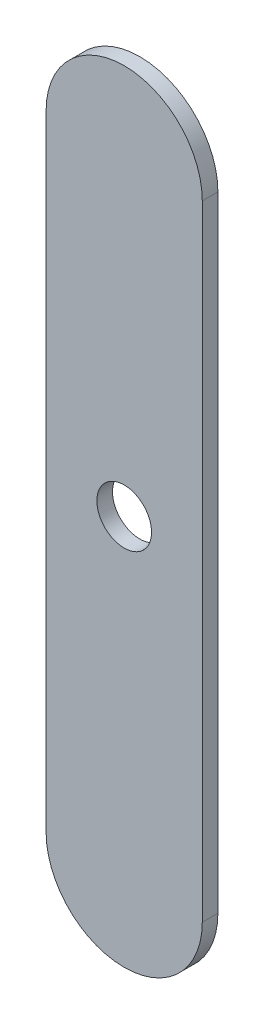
ISO-10303-21;
HEADER;
FILE_DESCRIPTION(('STEP AP214'),'2;1');
FILE_NAME('part.step','',(''),(''),'','','');
FILE_SCHEMA(('AUTOMOTIVE_DESIGN { 1 0 10303 214 1 1 1 1 }'));
ENDSEC;
DATA;
#1=APPLICATION_CONTEXT('core data for automotive mechanical design processes');
#2=APPLICATION_PROTOCOL_DEFINITION('international standard','automotive_design',2000,#1);
#3=PRODUCT_CONTEXT('',#1,'mechanical');
#4=PRODUCT('Part','Part','',(#3));
#5=PRODUCT_RELATED_PRODUCT_CATEGORY('part','',(#4));
#6=PRODUCT_DEFINITION_FORMATION('','',#4);
#7=PRODUCT_DEFINITION_CONTEXT('part definition',#1,'design');
#8=PRODUCT_DEFINITION('design','',#6,#7);
#9=PRODUCT_DEFINITION_SHAPE('','',#8);
#10=(LENGTH_UNIT() NAMED_UNIT(*) SI_UNIT(.MILLI.,.METRE.));
#11=(NAMED_UNIT(*) PLANE_ANGLE_UNIT() SI_UNIT($,.RADIAN.));
#12=(NAMED_UNIT(*) SI_UNIT($,.STERADIAN.) SOLID_ANGLE_UNIT());
#13=UNCERTAINTY_MEASURE_WITH_UNIT(LENGTH_MEASURE(1.E-05),#10,'distance_accuracy_value','');
#14=(GEOMETRIC_REPRESENTATION_CONTEXT(3) GLOBAL_UNCERTAINTY_ASSIGNED_CONTEXT((#13)) GLOBAL_UNIT_ASSIGNED_CONTEXT((#10,
#11,#12)) REPRESENTATION_CONTEXT('',''));
#15=CARTESIAN_POINT('',(0.,0.,0.));
#16=DIRECTION('',(0.,0.,1.));
#17=DIRECTION('',(1.,0.,0.));
#18=AXIS2_PLACEMENT_3D('',#15,#16,#17);
#19=CARTESIAN_POINT('',(0.,40.,1.));
#20=DIRECTION('',(0.,0.,1.));
#21=DIRECTION('',(1.,0.,0.));
#22=AXIS2_PLACEMENT_3D('',#19,#20,#21);
#23=PLANE('',#22);
#24=CARTESIAN_POINT('',(0.,40.,1.));
#25=DIRECTION('',(0.,0.,1.));
#26=DIRECTION('',(1.,0.,0.));
#27=AXIS2_PLACEMENT_3D('',#24,#25,#26);
#28=CIRCLE('',#27,5.);
#29=CARTESIAN_POINT('',(5.,40.,1.));
#30=VERTEX_POINT('',#29);
#31=CARTESIAN_POINT('',(-5.,40.,1.));
#32=VERTEX_POINT('',#31);
#33=EDGE_CURVE('E99',#30,#32,#28,.T.);
#34=ORIENTED_EDGE('',*,*,#33,.T.);
#35=DIRECTION('',(0.,-1.,0.));
#36=VECTOR('',#35,1.);
#37=CARTESIAN_POINT('',(-5.,40.,1.));
#38=LINE('',#37,#36);
#39=CARTESIAN_POINT('',(-5.,0.,1.));
#40=VERTEX_POINT('',#39);
#41=EDGE_CURVE('E84',#32,#40,#38,.T.);
#42=ORIENTED_EDGE('',*,*,#41,.T.);
#43=CARTESIAN_POINT('',(0.,0.,1.));
#44=DIRECTION('',(0.,0.,1.));
#45=DIRECTION('',(1.,0.,0.));
#46=AXIS2_PLACEMENT_3D('',#43,#44,#45);
#47=CIRCLE('',#46,5.);
#48=CARTESIAN_POINT('',(5.,0.,1.));
#49=VERTEX_POINT('',#48);
#50=EDGE_CURVE('E50',#40,#49,#47,.T.);
#51=ORIENTED_EDGE('',*,*,#50,.T.);
#52=DIRECTION('',(0.,1.,0.));
#53=VECTOR('',#52,1.);
#54=CARTESIAN_POINT('',(5.,40.,1.));
#55=LINE('',#54,#53);
#56=EDGE_CURVE('E45',#49,#30,#55,.T.);
#57=ORIENTED_EDGE('',*,*,#56,.T.);
#58=EDGE_LOOP('',(#34,#42,#51,#57));
#59=FACE_BOUND('',#58,.T.);
#60=CARTESIAN_POINT('',(0.,20.,1.));
#61=DIRECTION('',(0.,0.,1.));
#62=DIRECTION('',(1.,0.,0.));
#63=AXIS2_PLACEMENT_3D('',#60,#61,#62);
#64=CIRCLE('',#63,1.75);
#65=CARTESIAN_POINT('',(1.75,20.,1.));
#66=VERTEX_POINT('',#65);
#67=EDGE_CURVE('E89',#66,#66,#64,.T.);
#68=ORIENTED_EDGE('',*,*,#67,.F.);
#69=EDGE_LOOP('',(#68));
#70=FACE_BOUND('',#69,.T.);
#71=ADVANCED_FACE('F30',(#59,#70),#23,.T.);
#72=CARTESIAN_POINT('',(0.,40.,0.));
#73=DIRECTION('',(0.,0.,1.));
#74=DIRECTION('',(1.,0.,0.));
#75=AXIS2_PLACEMENT_3D('',#72,#73,#74);
#76=PLANE('',#75);
#77=CARTESIAN_POINT('',(0.,40.,0.));
#78=DIRECTION('',(0.,0.,1.));
#79=DIRECTION('',(1.,0.,0.));
#80=AXIS2_PLACEMENT_3D('',#77,#78,#79);
#81=CIRCLE('',#80,5.);
#82=CARTESIAN_POINT('',(5.,40.,0.));
#83=VERTEX_POINT('',#82);
#84=CARTESIAN_POINT('',(-5.,40.,0.));
#85=VERTEX_POINT('',#84);
#86=EDGE_CURVE('E76',#83,#85,#81,.T.);
#87=ORIENTED_EDGE('',*,*,#86,.F.);
#88=DIRECTION('',(0.,1.,0.));
#89=VECTOR('',#88,1.);
#90=CARTESIAN_POINT('',(5.,40.,0.));
#91=LINE('',#90,#89);
#92=CARTESIAN_POINT('',(5.,0.,0.));
#93=VERTEX_POINT('',#92);
#94=EDGE_CURVE('E97',#93,#83,#91,.T.);
#95=ORIENTED_EDGE('',*,*,#94,.F.);
#96=CARTESIAN_POINT('',(0.,0.,0.));
#97=DIRECTION('',(0.,0.,1.));
#98=DIRECTION('',(1.,0.,0.));
#99=AXIS2_PLACEMENT_3D('',#96,#97,#98);
#100=CIRCLE('',#99,5.);
#101=CARTESIAN_POINT('',(-5.,0.,0.));
#102=VERTEX_POINT('',#101);
#103=EDGE_CURVE('E77',#102,#93,#100,.T.);
#104=ORIENTED_EDGE('',*,*,#103,.F.);
#105=DIRECTION('',(0.,-1.,0.));
#106=VECTOR('',#105,1.);
#107=CARTESIAN_POINT('',(-5.,40.,0.));
#108=LINE('',#107,#106);
#109=EDGE_CURVE('E71',#85,#102,#108,.T.);
#110=ORIENTED_EDGE('',*,*,#109,.F.);
#111=EDGE_LOOP('',(#87,#95,#104,#110));
#112=FACE_BOUND('',#111,.T.);
#113=CARTESIAN_POINT('',(0.,20.,0.));
#114=DIRECTION('',(0.,0.,1.));
#115=DIRECTION('',(1.,0.,0.));
#116=AXIS2_PLACEMENT_3D('',#113,#114,#115);
#117=CIRCLE('',#116,1.75);
#118=CARTESIAN_POINT('',(1.75,20.,0.));
#119=VERTEX_POINT('',#118);
#120=EDGE_CURVE('E92',#119,#119,#117,.T.);
#121=ORIENTED_EDGE('',*,*,#120,.T.);
#122=EDGE_LOOP('',(#121));
#123=FACE_BOUND('',#122,.T.);
#124=ADVANCED_FACE('F72',(#112,#123),#76,.F.);
#125=CARTESIAN_POINT('',(0.,40.,1.));
#126=DIRECTION('',(0.,0.,-1.));
#127=DIRECTION('',(-1.,0.,0.));
#128=AXIS2_PLACEMENT_3D('',#125,#126,#127);
#129=CYLINDRICAL_SURFACE('',#128,5.);
#130=ORIENTED_EDGE('',*,*,#86,.T.);
#131=DIRECTION('',(0.,0.,-1.));
#132=VECTOR('',#131,1.);
#133=CARTESIAN_POINT('',(-5.,40.,1.));
#134=LINE('',#133,#132);
#135=EDGE_CURVE('E11',#32,#85,#134,.T.);
#136=ORIENTED_EDGE('',*,*,#135,.F.);
#137=ORIENTED_EDGE('',*,*,#33,.F.);
#138=DIRECTION('',(0.,0.,-1.));
#139=VECTOR('',#138,1.);
#140=CARTESIAN_POINT('',(5.,40.,1.));
#141=LINE('',#140,#139);
#142=EDGE_CURVE('E88',#30,#83,#141,.T.);
#143=ORIENTED_EDGE('',*,*,#142,.T.);
#144=EDGE_LOOP('',(#130,#136,#137,#143));
#145=FACE_BOUND('',#144,.T.);
#146=ADVANCED_FACE('F32',(#145),#129,.T.);
#147=CARTESIAN_POINT('',(-5.,40.,1.));
#148=DIRECTION('',(1.,0.,0.));
#149=DIRECTION('',(0.,0.,-1.));
#150=AXIS2_PLACEMENT_3D('',#147,#148,#149);
#151=PLANE('',#150);
#152=ORIENTED_EDGE('',*,*,#109,.T.);
#153=DIRECTION('',(0.,0.,-1.));
#154=VECTOR('',#153,1.);
#155=CARTESIAN_POINT('',(-5.,0.,1.));
#156=LINE('',#155,#154);
#157=EDGE_CURVE('E38',#40,#102,#156,.T.);
#158=ORIENTED_EDGE('',*,*,#157,.F.);
#159=ORIENTED_EDGE('',*,*,#41,.F.);
#160=ORIENTED_EDGE('',*,*,#135,.T.);
#161=EDGE_LOOP('',(#152,#158,#159,#160));
#162=FACE_BOUND('',#161,.T.);
#163=ADVANCED_FACE('F83',(#162),#151,.F.);
#164=CARTESIAN_POINT('',(0.,0.,1.));
#165=DIRECTION('',(0.,0.,-1.));
#166=DIRECTION('',(-1.,0.,0.));
#167=AXIS2_PLACEMENT_3D('',#164,#165,#166);
#168=CYLINDRICAL_SURFACE('',#167,5.);
#169=ORIENTED_EDGE('',*,*,#103,.T.);
#170=DIRECTION('',(0.,0.,-1.));
#171=VECTOR('',#170,1.);
#172=CARTESIAN_POINT('',(5.,0.,1.));
#173=LINE('',#172,#171);
#174=EDGE_CURVE('E105',#49,#93,#173,.T.);
#175=ORIENTED_EDGE('',*,*,#174,.F.);
#176=ORIENTED_EDGE('',*,*,#50,.F.);
#177=ORIENTED_EDGE('',*,*,#157,.T.);
#178=EDGE_LOOP('',(#169,#175,#176,#177));
#179=FACE_BOUND('',#178,.T.);
#180=ADVANCED_FACE('F108',(#179),#168,.T.);
#181=CARTESIAN_POINT('',(5.,40.,1.));
#182=DIRECTION('',(-1.,0.,0.));
#183=DIRECTION('',(0.,0.,1.));
#184=AXIS2_PLACEMENT_3D('',#181,#182,#183);
#185=PLANE('',#184);
#186=ORIENTED_EDGE('',*,*,#94,.T.);
#187=ORIENTED_EDGE('',*,*,#142,.F.);
#188=ORIENTED_EDGE('',*,*,#56,.F.);
#189=ORIENTED_EDGE('',*,*,#174,.T.);
#190=EDGE_LOOP('',(#186,#187,#188,#189));
#191=FACE_BOUND('',#190,.T.);
#192=ADVANCED_FACE('F110',(#191),#185,.F.);
#193=CARTESIAN_POINT('',(0.,20.,1.));
#194=DIRECTION('',(0.,0.,-1.));
#195=DIRECTION('',(-1.,0.,0.));
#196=AXIS2_PLACEMENT_3D('',#193,#194,#195);
#197=CYLINDRICAL_SURFACE('',#196,1.75);
#198=ORIENTED_EDGE('',*,*,#67,.T.);
#199=EDGE_LOOP('',(#198));
#200=FACE_BOUND('',#199,.T.);
#201=ORIENTED_EDGE('',*,*,#120,.F.);
#202=EDGE_LOOP('',(#201));
#203=FACE_BOUND('',#202,.T.);
#204=ADVANCED_FACE('F116',(#200,#203),#197,.F.);
#205=CLOSED_SHELL('',(#71,#124,#146,#163,#180,#192,#204));
#206=MANIFOLD_SOLID_BREP('B2',#205);
#207=ADVANCED_BREP_SHAPE_REPRESENTATION('',(#18,#206),#14);
#208=SHAPE_DEFINITION_REPRESENTATION(#9,#207);
ENDSEC;
END-ISO-10303-21;
